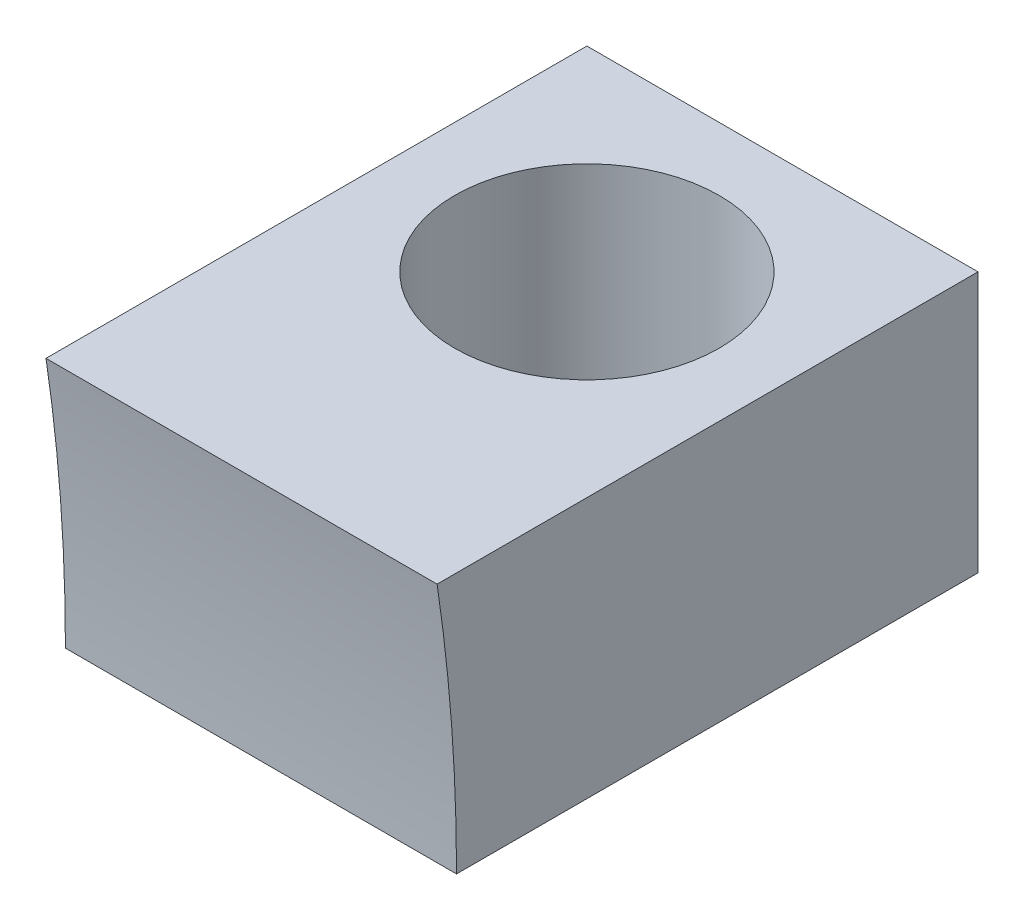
ISO-10303-21;
HEADER;
FILE_DESCRIPTION(('STEP AP214'),'2;1');
FILE_NAME('part.step','',(''),(''),'','','');
FILE_SCHEMA(('AUTOMOTIVE_DESIGN { 1 0 10303 214 1 1 1 1 }'));
ENDSEC;
DATA;
#1=APPLICATION_CONTEXT('core data for automotive mechanical design processes');
#2=APPLICATION_PROTOCOL_DEFINITION('international standard','automotive_design',2000,#1);
#3=PRODUCT_CONTEXT('',#1,'mechanical');
#4=PRODUCT('Part','Part','',(#3));
#5=PRODUCT_RELATED_PRODUCT_CATEGORY('part','',(#4));
#6=PRODUCT_DEFINITION_FORMATION('','',#4);
#7=PRODUCT_DEFINITION_CONTEXT('part definition',#1,'design');
#8=PRODUCT_DEFINITION('design','',#6,#7);
#9=PRODUCT_DEFINITION_SHAPE('','',#8);
#10=(LENGTH_UNIT() NAMED_UNIT(*) SI_UNIT(.MILLI.,.METRE.));
#11=(NAMED_UNIT(*) PLANE_ANGLE_UNIT() SI_UNIT($,.RADIAN.));
#12=(NAMED_UNIT(*) SI_UNIT($,.STERADIAN.) SOLID_ANGLE_UNIT());
#13=UNCERTAINTY_MEASURE_WITH_UNIT(LENGTH_MEASURE(1.E-05),#10,'distance_accuracy_value','');
#14=(GEOMETRIC_REPRESENTATION_CONTEXT(3) GLOBAL_UNCERTAINTY_ASSIGNED_CONTEXT((#13)) GLOBAL_UNIT_ASSIGNED_CONTEXT((#10,
#11,#12)) REPRESENTATION_CONTEXT('',''));
#15=CARTESIAN_POINT('',(0.,0.,0.));
#16=DIRECTION('',(0.,0.,1.));
#17=DIRECTION('',(1.,0.,0.));
#18=AXIS2_PLACEMENT_3D('',#15,#16,#17);
#19=CARTESIAN_POINT('',(3.81,-2.54,39.37));
#20=DIRECTION('',(-1.,0.,0.));
#21=DIRECTION('',(0.,0.,1.));
#22=AXIS2_PLACEMENT_3D('',#19,#20,#21);
#23=CYLINDRICAL_SURFACE('',#22,34.29);
#24=CARTESIAN_POINT('',(-3.81,-2.54,39.37));
#25=DIRECTION('',(-1.,0.,0.));
#26=DIRECTION('',(0.,0.,-1.));
#27=AXIS2_PLACEMENT_3D('',#24,#25,#26);
#28=CIRCLE('',#27,34.29);
#29=CARTESIAN_POINT('',(-3.81,2.54,5.45838399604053));
#30=VERTEX_POINT('',#29);
#31=CARTESIAN_POINT('',(-3.81,-2.54,5.08));
#32=VERTEX_POINT('',#31);
#33=EDGE_CURVE('E96',#30,#32,#28,.T.);
#34=ORIENTED_EDGE('',*,*,#33,.T.);
#35=DIRECTION('',(-1.,0.,0.));
#36=VECTOR('',#35,1.);
#37=CARTESIAN_POINT('',(3.81,-2.54,5.08));
#38=LINE('',#37,#36);
#39=CARTESIAN_POINT('',(3.81,-2.54,5.08));
#40=VERTEX_POINT('',#39);
#41=EDGE_CURVE('E11',#40,#32,#38,.T.);
#42=ORIENTED_EDGE('',*,*,#41,.F.);
#43=CARTESIAN_POINT('',(3.81,-2.54,39.37));
#44=DIRECTION('',(-1.,0.,0.));
#45=DIRECTION('',(0.,0.,-1.));
#46=AXIS2_PLACEMENT_3D('',#43,#44,#45);
#47=CIRCLE('',#46,34.29);
#48=CARTESIAN_POINT('',(3.81,2.54,5.45838399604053));
#49=VERTEX_POINT('',#48);
#50=EDGE_CURVE('E84',#49,#40,#47,.T.);
#51=ORIENTED_EDGE('',*,*,#50,.F.);
#52=DIRECTION('',(-1.,0.,0.));
#53=VECTOR('',#52,1.);
#54=CARTESIAN_POINT('',(3.81,2.54,5.45838399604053));
#55=LINE('',#54,#53);
#56=EDGE_CURVE('E92',#49,#30,#55,.T.);
#57=ORIENTED_EDGE('',*,*,#56,.T.);
#58=EDGE_LOOP('',(#34,#42,#51,#57));
#59=FACE_BOUND('',#58,.T.);
#60=ADVANCED_FACE('F33',(#59),#23,.F.);
#61=CARTESIAN_POINT('',(3.81,-2.54,-5.08));
#62=DIRECTION('',(0.,1.,0.));
#63=DIRECTION('',(0.,0.,1.));
#64=AXIS2_PLACEMENT_3D('',#61,#62,#63);
#65=PLANE('',#64);
#66=CARTESIAN_POINT('',(0.,-2.54,-1.27));
#67=DIRECTION('',(0.,-1.,0.));
#68=DIRECTION('',(0.,0.,-1.));
#69=AXIS2_PLACEMENT_3D('',#66,#67,#68);
#70=CIRCLE('',#69,2.5781);
#71=CARTESIAN_POINT('',(0.,-2.54,-3.8481));
#72=VERTEX_POINT('',#71);
#73=EDGE_CURVE('E110',#72,#72,#70,.T.);
#74=ORIENTED_EDGE('',*,*,#73,.F.);
#75=EDGE_LOOP('',(#74));
#76=FACE_BOUND('',#75,.T.);
#77=DIRECTION('',(0.,0.,-1.));
#78=VECTOR('',#77,1.);
#79=CARTESIAN_POINT('',(-3.81,-2.54,-5.08));
#80=LINE('',#79,#78);
#81=CARTESIAN_POINT('',(-3.81,-2.54,-5.08));
#82=VERTEX_POINT('',#81);
#83=EDGE_CURVE('E88',#32,#82,#80,.T.);
#84=ORIENTED_EDGE('',*,*,#83,.T.);
#85=DIRECTION('',(-1.,0.,0.));
#86=VECTOR('',#85,1.);
#87=CARTESIAN_POINT('',(3.81,-2.54,-5.08));
#88=LINE('',#87,#86);
#89=CARTESIAN_POINT('',(3.81,-2.54,-5.08));
#90=VERTEX_POINT('',#89);
#91=EDGE_CURVE('E41',#90,#82,#88,.T.);
#92=ORIENTED_EDGE('',*,*,#91,.F.);
#93=DIRECTION('',(0.,0.,-1.));
#94=VECTOR('',#93,1.);
#95=CARTESIAN_POINT('',(3.81,-2.54,-5.08));
#96=LINE('',#95,#94);
#97=EDGE_CURVE('E79',#40,#90,#96,.T.);
#98=ORIENTED_EDGE('',*,*,#97,.F.);
#99=ORIENTED_EDGE('',*,*,#41,.T.);
#100=EDGE_LOOP('',(#84,#92,#98,#99));
#101=FACE_BOUND('',#100,.T.);
#102=ADVANCED_FACE('F87',(#76,#101),#65,.F.);
#103=CARTESIAN_POINT('',(3.81,2.54,-5.08));
#104=DIRECTION('',(0.,0.,1.));
#105=DIRECTION('',(1.,0.,0.));
#106=AXIS2_PLACEMENT_3D('',#103,#104,#105);
#107=PLANE('',#106);
#108=DIRECTION('',(0.,1.,0.));
#109=VECTOR('',#108,1.);
#110=CARTESIAN_POINT('',(-3.81,2.54,-5.08));
#111=LINE('',#110,#109);
#112=CARTESIAN_POINT('',(-3.81,2.54,-5.08));
#113=VERTEX_POINT('',#112);
#114=EDGE_CURVE('E66',#82,#113,#111,.T.);
#115=ORIENTED_EDGE('',*,*,#114,.T.);
#116=DIRECTION('',(-1.,0.,0.));
#117=VECTOR('',#116,1.);
#118=CARTESIAN_POINT('',(3.81,2.54,-5.08));
#119=LINE('',#118,#117);
#120=CARTESIAN_POINT('',(3.81,2.54,-5.08));
#121=VERTEX_POINT('',#120);
#122=EDGE_CURVE('E89',#121,#113,#119,.T.);
#123=ORIENTED_EDGE('',*,*,#122,.F.);
#124=DIRECTION('',(0.,1.,0.));
#125=VECTOR('',#124,1.);
#126=CARTESIAN_POINT('',(3.81,2.54,-5.08));
#127=LINE('',#126,#125);
#128=EDGE_CURVE('E82',#90,#121,#127,.T.);
#129=ORIENTED_EDGE('',*,*,#128,.F.);
#130=ORIENTED_EDGE('',*,*,#91,.T.);
#131=EDGE_LOOP('',(#115,#123,#129,#130));
#132=FACE_BOUND('',#131,.T.);
#133=ADVANCED_FACE('F90',(#132),#107,.F.);
#134=CARTESIAN_POINT('',(3.81,2.54,5.45838399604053));
#135=DIRECTION('',(0.,-1.,0.));
#136=DIRECTION('',(0.,0.,-1.));
#137=AXIS2_PLACEMENT_3D('',#134,#135,#136);
#138=PLANE('',#137);
#139=CARTESIAN_POINT('',(0.,2.54,-1.27));
#140=DIRECTION('',(0.,-1.,0.));
#141=DIRECTION('',(0.,0.,-1.));
#142=AXIS2_PLACEMENT_3D('',#139,#140,#141);
#143=CIRCLE('',#142,2.5781);
#144=CARTESIAN_POINT('',(0.,2.54,-3.8481));
#145=VERTEX_POINT('',#144);
#146=EDGE_CURVE('E99',#145,#145,#143,.T.);
#147=ORIENTED_EDGE('',*,*,#146,.T.);
#148=EDGE_LOOP('',(#147));
#149=FACE_BOUND('',#148,.T.);
#150=DIRECTION('',(0.,0.,1.));
#151=VECTOR('',#150,1.);
#152=CARTESIAN_POINT('',(-3.81,2.54,5.45838399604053));
#153=LINE('',#152,#151);
#154=EDGE_CURVE('E72',#113,#30,#153,.T.);
#155=ORIENTED_EDGE('',*,*,#154,.T.);
#156=ORIENTED_EDGE('',*,*,#56,.F.);
#157=DIRECTION('',(0.,0.,1.));
#158=VECTOR('',#157,1.);
#159=CARTESIAN_POINT('',(3.81,2.54,5.45838399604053));
#160=LINE('',#159,#158);
#161=EDGE_CURVE('E49',#121,#49,#160,.T.);
#162=ORIENTED_EDGE('',*,*,#161,.F.);
#163=ORIENTED_EDGE('',*,*,#122,.T.);
#164=EDGE_LOOP('',(#155,#156,#162,#163));
#165=FACE_BOUND('',#164,.T.);
#166=ADVANCED_FACE('F104',(#149,#165),#138,.F.);
#167=CARTESIAN_POINT('',(3.81,-2.54,39.37));
#168=DIRECTION('',(1.,0.,0.));
#169=DIRECTION('',(0.,0.,-1.));
#170=AXIS2_PLACEMENT_3D('',#167,#168,#169);
#171=PLANE('',#170);
#172=ORIENTED_EDGE('',*,*,#50,.T.);
#173=ORIENTED_EDGE('',*,*,#97,.T.);
#174=ORIENTED_EDGE('',*,*,#128,.T.);
#175=ORIENTED_EDGE('',*,*,#161,.T.);
#176=EDGE_LOOP('',(#172,#173,#174,#175));
#177=FACE_BOUND('',#176,.T.);
#178=ADVANCED_FACE('F80',(#177),#171,.T.);
#179=CARTESIAN_POINT('',(-3.81,-2.54,39.37));
#180=DIRECTION('',(1.,0.,0.));
#181=DIRECTION('',(0.,0.,-1.));
#182=AXIS2_PLACEMENT_3D('',#179,#180,#181);
#183=PLANE('',#182);
#184=ORIENTED_EDGE('',*,*,#33,.F.);
#185=ORIENTED_EDGE('',*,*,#154,.F.);
#186=ORIENTED_EDGE('',*,*,#114,.F.);
#187=ORIENTED_EDGE('',*,*,#83,.F.);
#188=EDGE_LOOP('',(#184,#185,#186,#187));
#189=FACE_BOUND('',#188,.T.);
#190=ADVANCED_FACE('F107',(#189),#183,.F.);
#191=CARTESIAN_POINT('',(0.,2.54,-1.27));
#192=DIRECTION('',(0.,-1.,0.));
#193=DIRECTION('',(0.,0.,-1.));
#194=AXIS2_PLACEMENT_3D('',#191,#192,#193);
#195=CYLINDRICAL_SURFACE('',#194,2.5781);
#196=ORIENTED_EDGE('',*,*,#146,.F.);
#197=EDGE_LOOP('',(#196));
#198=FACE_BOUND('',#197,.T.);
#199=ORIENTED_EDGE('',*,*,#73,.T.);
#200=EDGE_LOOP('',(#199));
#201=FACE_BOUND('',#200,.T.);
#202=ADVANCED_FACE('F117',(#198,#201),#195,.F.);
#203=CLOSED_SHELL('',(#60,#102,#133,#166,#178,#190,#202));
#204=MANIFOLD_SOLID_BREP('B2',#203);
#205=ADVANCED_BREP_SHAPE_REPRESENTATION('',(#18,#204),#14);
#206=SHAPE_DEFINITION_REPRESENTATION(#9,#205);
ENDSEC;
END-ISO-10303-21;
